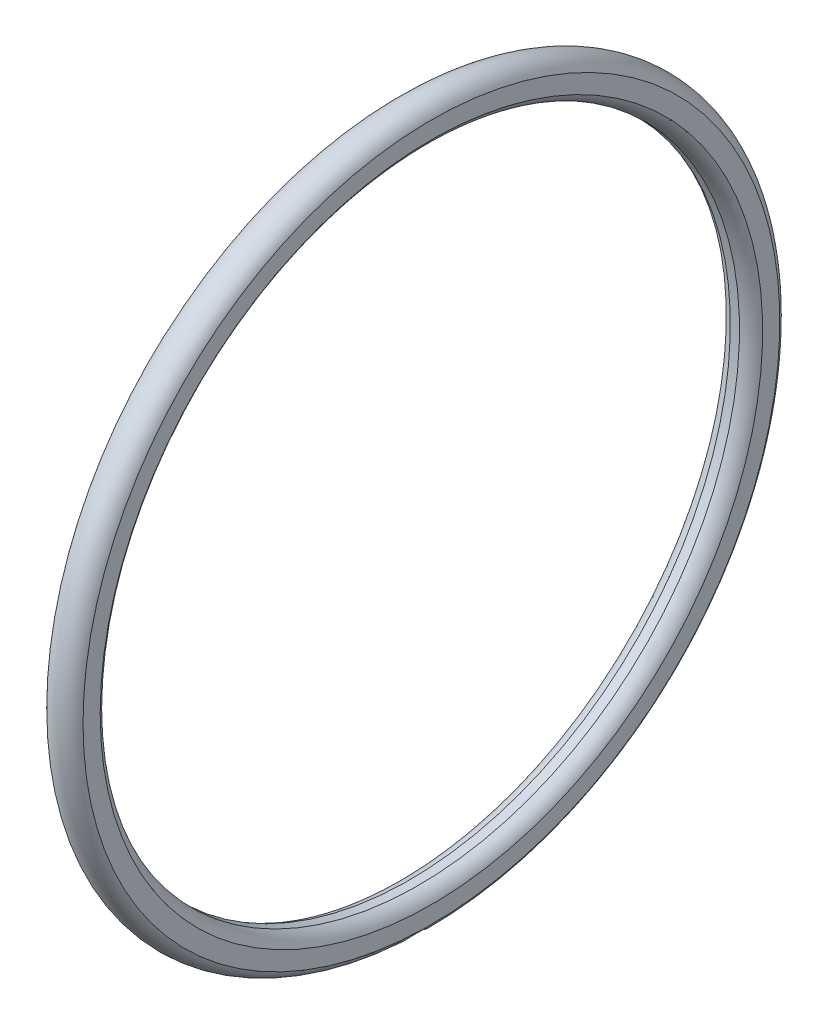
from build123d import *


with BuildPart() as part:
    # Esquisse1 → R_volution1 (revolve)
    with BuildSketch(Plane.XY, mode=Mode.PRIVATE) as r_volution1_sk:
        with BuildLine():
            Line((-2.6, 47.403987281), (-2.6, 46.146012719))
            ThreePointArc((-2.6, 46.146012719), (-1.89151064, 44.88348936), (-0.628987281, 44.175))
            Line((-0.628987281, 44.175), (0.628987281, 44.175))
            ThreePointArc((0.628987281, 44.175), (1.672370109, 44.687225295), (2.4, 45.593634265))
            Line((2.4, 45.593634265), (2.4, 47.956365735))
            ThreePointArc((2.4, 47.956365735), (-0.293735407, 49.433823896), (-2.6, 47.403987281))
        make_face()
    revolve(r_volution1_sk.sketch.rotate(Axis((-19.55210295, 0, 0), (1, 0, 0)), 90), axis=Axis((-19.55210295, 0, 0), (1, 0, 0)))


solid = part.part
